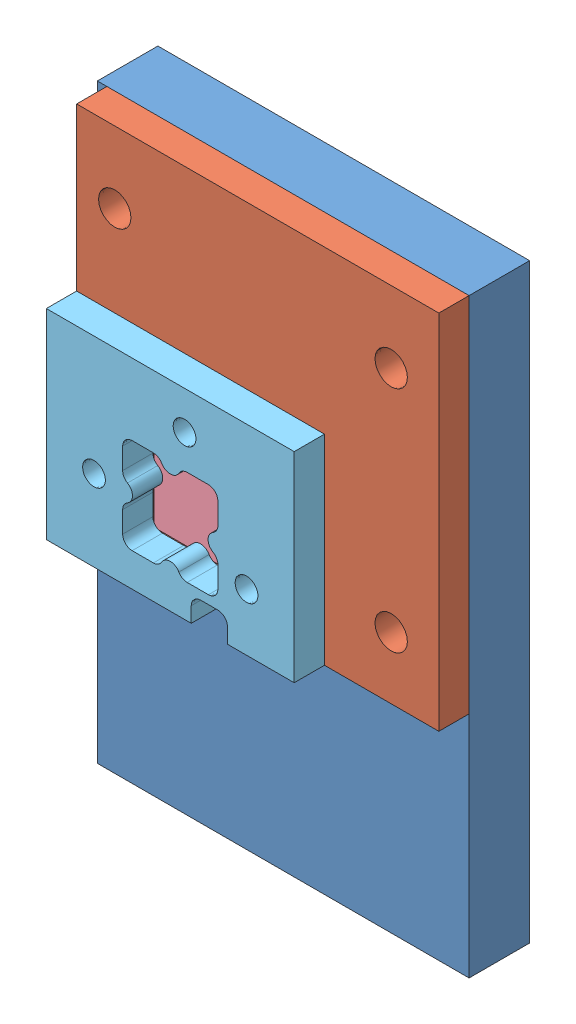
SolidWorks assembly SHWS_Stationary_Mount.SLDASM, configuration Default (file format 7000). Lengths in mm.
Overall size (39.25 62 14.54).
5 component instances, 5 part files, 11 mates.
Components (placement in the parent):
- SHWS_Detector_Mount-1: SHWS_Detector_Mount.SLDPRT [Default] at origin size (39 62 6.35)
- MLA_Mount-1: MLA_Mount.SLDPRT [Default] at (0.5 12 6.35) size (38 38 3.17)
- 11088284_Volumenmodell_2-1: 11088284_Volumenmodell_2.sldprt [Default] at (-5.5 1.5 2.54) x (0 1 0) z (-1 0 0) size (28.5 7.13 28.5)
- lenslet_array-1: lenslet_array.SLDPRT [Default] at (-10.5 -3.5 8.225) size (10 10 1.2)
- MLA_Plate-1: MLA_Plate.SLDPRT [Default] at (-4.716 5.7561 9.525) size (26 21 3.17)
Mates (geometry in assembly coordinates):
- Coincident1: coincident aligned: plane of SHWS_Detector_Mount-1 through (-19.5 31 6.35) normal (0 1 0); plane of MLA_Mount-1 through (-18.5 31 9.525) normal (0 1 0)
- Coincident3: coincident anti-aligned: plane of SHWS_Detector_Mount-1 through (0 0 2.54) normal (0 0 -1); plane of 11088284_Volumenmodell_2-1 through (-15 15.5 2.54) normal (0 0 1)
- Concentric1: concentric aligned: cylinder of SHWS_Detector_Mount-1 through (-5.5 13.5 6.35) axis (0 0 1) radius 0.8; cylinder of 11088284_Volumenmodell_2-1 through (-5.5 13.5 0.66) axis (0 0 1) radius 0.9
- Concentric2: concentric aligned: cylinder of SHWS_Detector_Mount-1 through (-12.5 -10.5 6.35) axis (0 0 1) radius 0.8; cylinder of 11088284_Volumenmodell_2-1 through (-12.5 -10.5 0.66) axis (0 0 1) radius 0.9
- Coincident4: coincident aligned: plane of SHWS_Detector_Mount-1 through (19.5 -31 6.35) normal (1 0 0); plane of MLA_Mount-1 through (19.5 -7 9.525) normal (1 0 0)
- Coincident7: coincident anti-aligned: plane of MLA_Mount-1 through (-4.4645 -3.5 6.35) normal (0 1 0); plane of lenslet_array-1 through (-10.5 -3.5 9.425) normal (0 -1 0)
- Coincident79: coincident anti-aligned: plane of SHWS_Detector_Mount-1 through (0 0 6.35) normal (0 0 1); plane of MLA_Mount-1 through (0.5 12 6.35) normal (0 0 -1)
- Coincident80: coincident anti-aligned: plane of MLA_Mount-1 through (-0.5 6.5 6.35) normal (-1 0 0); plane of lenslet_array-1 through (-0.5 -3.5 9.425) normal (1 0 0)
- Coincident82: coincident anti-aligned: plane of MLA_Mount-1 through (0.5 12 8.225) normal (0 0 1); plane of lenslet_array-1 through (-10.5 -3.5 8.225) normal (0 0 -1)
- Coincident83: coincident anti-aligned: plane of MLA_Mount-1 through (0.5 12 9.525) normal (0 0 1); plane of MLA_Plate-1 through (-4.716 5.7561 9.525) normal (0 0 -1)
- Concentric3: concentric aligned: cylinder of MLA_Mount-1 through (-4 10 9.525) axis (0 0 1) radius 0.8; cylinder of MLA_Plate-1 through (-4 10 9.525) axis (0 0 1) radius 1.2
